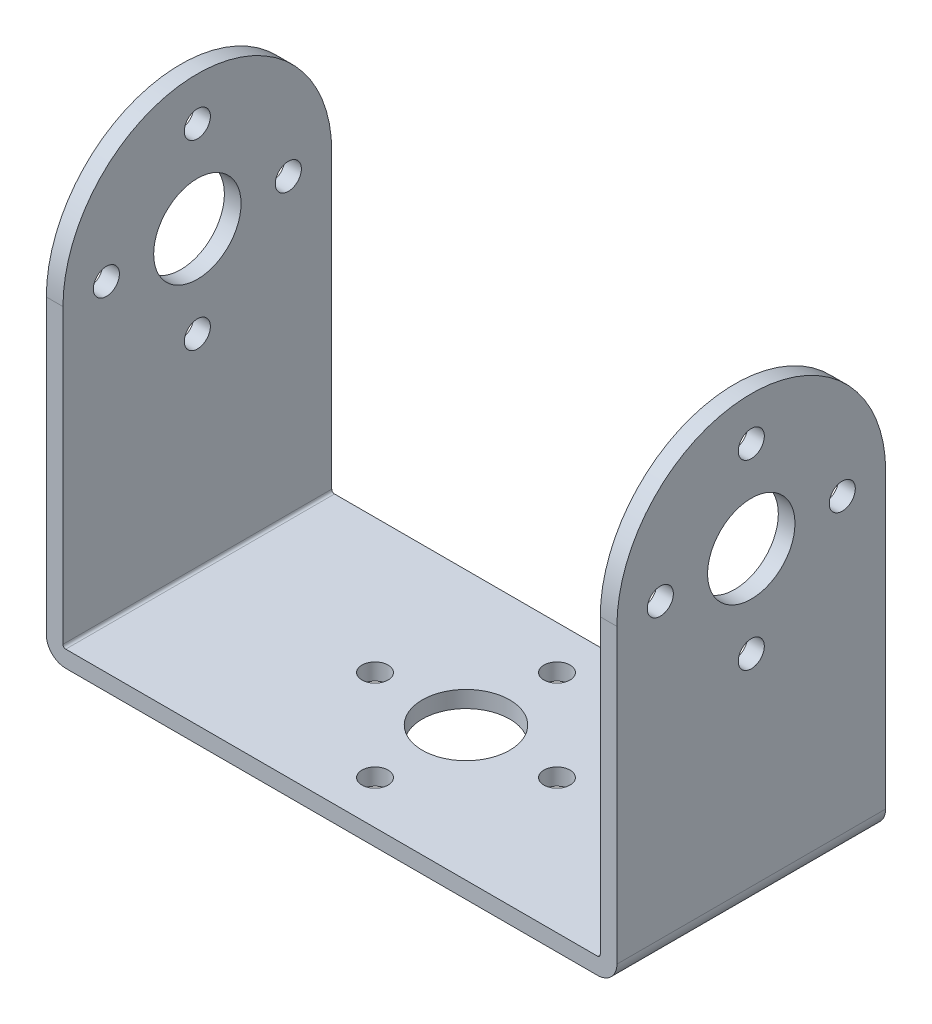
from build123d import *

# Parameters (mm, degrees)
SKETCH1_W               = 49.1998
SKETCH1_H               = 24.6126
SKETCH1_R               = 1.1938
SKETCH1_R_2             = 4.0005
EXTRUDE1_DEPTH          = 1.524
SKETCH1_3_W             = 1.524
SKETCH1_3_H             = 24.6126
EXTRUDE2_DEPTH          = 40.8686
CUT_EXTRUDE1_DEPTH      = 40.8686
CUT_EXTRUDE1_DEPTH_BACK = 40.8686
SKETCH4_R               = 4.0005
SKETCH4_R_2             = 1.1938
FILLET1_R               = 0.254
FILLET2_R               = 1.778


with BuildPart() as part:
    # Sketch1 → Extrude1 (new body)
    with BuildSketch(Plane(origin=(0, 0, 0), x_dir=(1, 0, 0), z_dir=(0, 1, 0))):
        Rectangle(SKETCH1_W, SKETCH1_H)
        with Locations(Location((-8.3312, 0, 0), (0, 0, 90))):
            Circle(SKETCH1_R, mode=Mode.SUBTRACT)
        with Locations(Location((0, -8.3312, 0), (0, 0, 90))):
            Circle(SKETCH1_R, mode=Mode.SUBTRACT)
        with Locations(Location((0, 0, 0), (0, 0, 90))):
            Circle(SKETCH1_R_2, mode=Mode.SUBTRACT)
        with Locations(Location((8.3312, 0, 0), (0, 0, 90))):
            Circle(SKETCH1_R, mode=Mode.SUBTRACT)
        with Locations(Location((0, 8.3312, 0), (0, 0, 90))):
            Circle(SKETCH1_R, mode=Mode.SUBTRACT)
    extrude(amount=EXTRUDE1_DEPTH)

    # Sketch1_3 → Extrude2 (add)
    with BuildSketch(Plane(origin=(0, 0, 0), x_dir=(1, 0, 0), z_dir=(0, 1, 0))):
        with Locations((25.3619, 0)):
            Rectangle(SKETCH1_3_W, SKETCH1_3_H)
        with Locations((-25.3619, 0)):
            Rectangle(SKETCH1_3_W, SKETCH1_3_H)
    extrude(amount=EXTRUDE2_DEPTH)

    # Sketch4 → Cut-Extrude1 (cut, two sides: drawn at the far end of the back side and taken through both)
    with BuildSketch(Plane(origin=(0, 0, 0), x_dir=(0, 0, -1), z_dir=(1, 0, 0)).offset(-CUT_EXTRUDE1_DEPTH_BACK)):
        with BuildLine():
            Line((0, 40.8686), (-12.3063, 40.8686))
            Line((-12.3063, 40.8686), (-12.3063, 28.5623))
            ThreePointArc((-12.3063, 28.5623), (-8.701868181, 37.264168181), (0, 40.8686))
        make_face()
        with BuildLine():
            Line((12.3063, 40.8686), (0, 40.8686))
            ThreePointArc((0, 40.8686), (8.701868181, 37.264168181), (12.3063, 28.5623))
            Line((12.3063, 28.5623), (12.3063, 40.8686))
        make_face()
        with Locations((0, 28.575)):
            Circle(SKETCH4_R)
        with Locations((8.3312, 28.575)):
            Circle(SKETCH4_R_2)
        with Locations((0, 36.9062)):
            Circle(SKETCH4_R_2)
        with Locations((-8.3312, 28.575)):
            Circle(SKETCH4_R_2)
        with Locations((0, 20.2438)):
            Circle(SKETCH4_R_2)
    extrude(amount=CUT_EXTRUDE1_DEPTH + CUT_EXTRUDE1_DEPTH_BACK, mode=Mode.SUBTRACT)

    # Fillet1
    fillet1_edges = [part.edges().sort_by_distance(p)[0] for p in [
        (-24.5999, 1.524, 0),
        (24.5999, 1.524, 0),
    ]]
    fillet(fillet1_edges, radius=FILLET1_R)

    # Fillet2
    fillet2_edges = [part.edges().sort_by_distance(p)[0] for p in [
        (-26.1239, 0, 0),
        (26.1239, 0, 0),
    ]]
    fillet(fillet2_edges, radius=FILLET2_R)


solid = part.part
